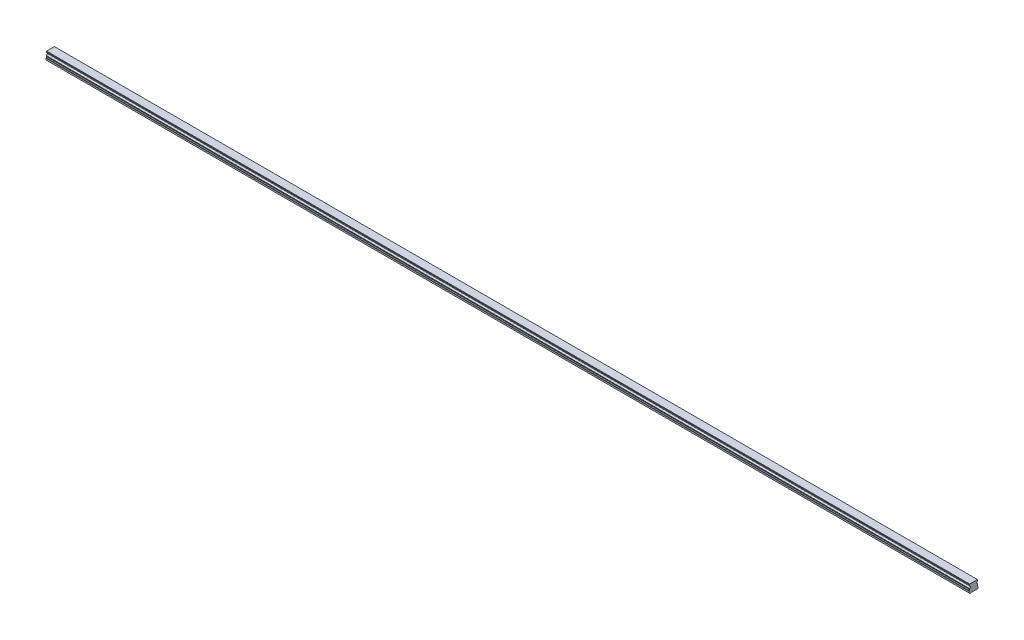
from build123d import *

# Parameters (mm, degrees)
BOSS_EXTRUDE1_DEPTH        = 1560
SKETCH3_R                  = 2.5
SKETCH3_R_2                = 2.1
CUT_EXTRUDE3_DEPTH         = 7
SKETCH3_2_R                = 2.1
CUT_EXTRUDE4_DEPTH         = 9.5
CHAMFER1_SIZE              = 0.4
LPATTERN2_COUNT            = 26
LPATTERN2_PITCH            = 60
CHAMFER1_OF_LPATTERN2_SIZE = 0.4


with BuildPart() as part:
    # Sketch1 → Boss-Extrude1 (new body)
    with BuildSketch(Plane(origin=(0, 0, 0), x_dir=(0, 0, -1), z_dir=(1, 0, 0))):
        with BuildLine():
            Line((6.59, 14), (-6.59, 14))
            Line((-6.59, 14), (-6.59, 13.15))
            Line((-6.59, 13.15), (-6.96, 12.356532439))
            Line((-6.96, 12.356532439), (-6.96, 11.435174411))
            ThreePointArc((-6.96, 11.435174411), (-5.25, 9.5), (-6.96, 7.564825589))
            Line((-6.96, 7.564825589), (-6.96, 6.643467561))
            Line((-6.96, 6.643467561), (-6.59, 5.85))
            Line((-6.59, 5.85), (-7.032116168, 4.2))
            Line((-7.032116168, 4.2), (-7.5, 3.929867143))
            Line((-7.5, 3.929867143), (-7.5, 1.4))
            Line((-7.5, 1.4), (-6.1, 0))
            Line((-6.1, 0), (-3.65, 0))
            Line((-3.65, 0), (-3.25, 0.4))
            Line((-3.25, 0.4), (3.25, 0.4))
            Line((3.25, 0.4), (3.65, 0))
            Line((3.65, 0), (6.1, 0))
            Line((6.1, 0), (7.5, 1.4))
            Line((7.5, 1.4), (7.5, 3.929867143))
            Line((7.5, 3.929867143), (7.032116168, 4.2))
            Line((7.032116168, 4.2), (6.59, 5.85))
            Line((6.59, 5.85), (6.96, 6.643467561))
            Line((6.96, 6.643467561), (6.96, 7.564825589))
            ThreePointArc((6.96, 7.564825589), (5.25, 9.5), (6.96, 11.435174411))
            Line((6.96, 11.435174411), (6.96, 12.356532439))
            Line((6.96, 12.356532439), (6.59, 13.15))
            Line((6.59, 13.15), (6.59, 14))
        make_face()
    extrude(amount=BOSS_EXTRUDE1_DEPTH)

    # Sketch3 → Cut-Extrude3 (cut)
    with BuildSketch(Plane.XZ):
        with Locations(Location((30, 0, 0), (0, 0, 270))):
            Circle(SKETCH3_R)
        with Locations(Location((30, 0, 0), (0, 0, 270))):
            Circle(SKETCH3_R_2, mode=Mode.SUBTRACT)
    cut_extrude3 = extrude(amount=-CUT_EXTRUDE3_DEPTH, mode=Mode.SUBTRACT)

    # Sketch3_2 → Cut-Extrude4 (cut)
    with BuildSketch(Plane.XZ):
        with Locations(Location((30, 0, 0), (0, 0, 270))):
            Circle(SKETCH3_2_R)
    cut_extrude4 = extrude(amount=-CUT_EXTRUDE4_DEPTH, mode=Mode.SUBTRACT)

    # Cut-Extrude5 cone 1 section (on through the dimple's axis) → Cut-Extrude5 (revolve, cut)
    with BuildSketch(Plane(origin=(30, 9.5, 0), x_dir=(0, 0, -1), z_dir=(1, 0, 0))):
        Polygon((0, 0), (2.1, 0), (0, 1.212435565), align=None)
    revolve(axis=Axis((30, 9.5, 0), (0, 1, 0)), mode=Mode.SUBTRACT)

    # Chamfer1
    chamfer1_edges = [part.edges().sort_by_distance(p)[0] for p in [
        (30, 0.4, 2.5),
    ]]
    chamfer(chamfer1_edges, length=CHAMFER1_SIZE)

    # LPattern2: Cut-Extrude3, Cut-Extrude4 ×26
    with Locations(*[(i * LPATTERN2_PITCH, 0, 0) for i in range(1, LPATTERN2_COUNT)]):
        add(cut_extrude3, mode=Mode.SUBTRACT)
        add(cut_extrude4, mode=Mode.SUBTRACT)

    # Chamfer1 of LPattern2
    chamfer1_of_lpattern2_edges = [part.edges().sort_by_distance(p)[0] for p in [
        (90, 0.4, 2.5),
        (150, 0.4, 2.5),
        (210, 0.4, 2.5),
        (270, 0.4, 2.5),
        (330, 0.4, 2.5),
        (390, 0.4, 2.5),
        (450, 0.4, 2.5),
        (510, 0.4, 2.5),
        (570, 0.4, 2.5),
        (630, 0.4, 2.5),
        (690, 0.4, 2.5),
        (750, 0.4, 2.5),
        (810, 0.4, 2.5),
        (870, 0.4, 2.5),
        (930, 0.4, 2.5),
        (990, 0.4, 2.5),
        (1050, 0.4, 2.5),
        (1110, 0.4, 2.5),
        (1170, 0.4, 2.5),
        (1230, 0.4, 2.5),
        (1290, 0.4, 2.5),
        (1350, 0.4, 2.5),
        (1410, 0.4, 2.5),
        (1470, 0.4, 2.5),
        (1530, 0.4, 2.5),
    ]]
    chamfer(chamfer1_of_lpattern2_edges, length=CHAMFER1_OF_LPATTERN2_SIZE)


solid = part.part
